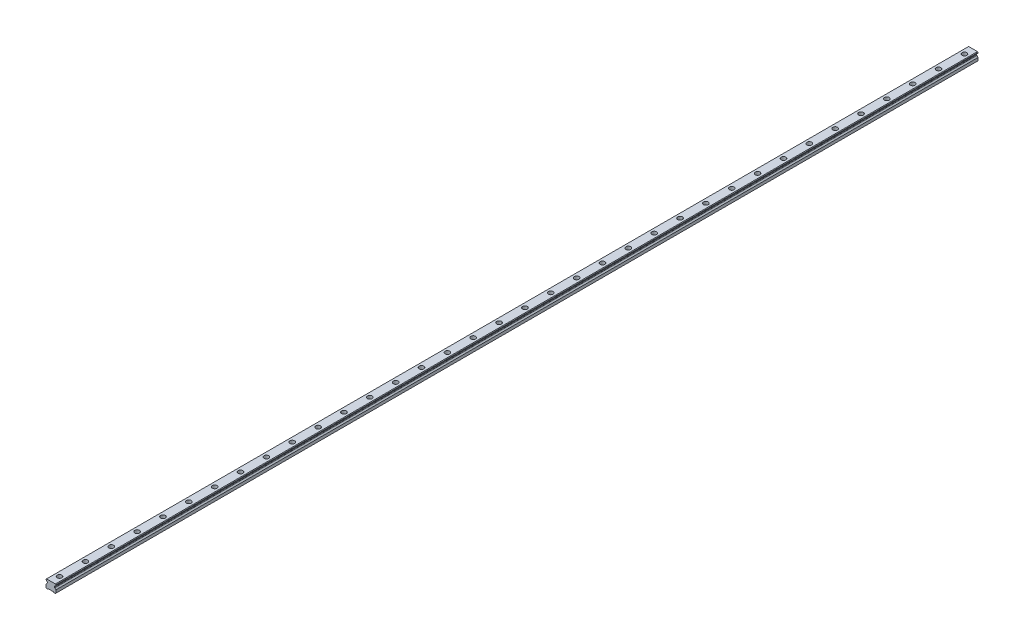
from build123d import *

# Parameters (mm, degrees)
SKETCH1_W           = 23
SKETCH1_H           = 19.2
BOSS_EXTRUDE1_DEPTH = 1070
CUT_EXTRUDE1_DEPTH  = 2141.117027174
CHAMFER1_SIZE       = 1.25
FILLET1_R           = 1.25
CUT_EXTRUDE2_DEPTH  = 2141.117027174
SKETCH4_R           = 5.5
SKETCH4_R_2         = 3.5
CUT_EXTRUDE3_DEPTH  = 9
SKETCH4_2_R         = 3.5
CUT_EXTRUDE4_DEPTH  = 1071.234035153
LPATTERN1_COUNT     = 36
LPATTERN1_PITCH     = 60


with BuildPart() as part:
    # Sketch1 → Boss-Extrude1 (new, symmetric)
    with BuildSketch(Plane.XY):
        with Locations((0, 9.6)):
            Rectangle(SKETCH1_W, SKETCH1_H)
    extrude(amount=BOSS_EXTRUDE1_DEPTH, both=True)

    # Sketch2 → Cut-Extrude1 (cut, through all)
    with BuildSketch(Plane.XY.offset(1070)):
        Polygon((-11.5, 16.7), (-11.5, 7.95), (-8.583333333, 10.866666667), (-8.583333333, 13.783333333), align=None)
        Polygon((8.583333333, 13.783333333), (11.5, 16.7), (11.5, 7.95), (8.583333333, 10.866666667), align=None)
    extrude(amount=-CUT_EXTRUDE1_DEPTH, mode=Mode.SUBTRACT)

    # Chamfer1
    chamfer1_edges = [part.edges().sort_by_distance(p)[0] for p in [
        (-11.5, 19.2, 0),
        (11.5, 19.2, 0),
        (11.5, 0, 0),
        (-11.5, 0, 0),
    ]]
    chamfer(chamfer1_edges, length=CHAMFER1_SIZE)

    # Fillet1
    fillet1_edges = [part.edges().sort_by_distance(p)[0] for p in [
        (-8.583333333, 13.783333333, 0),
        (-8.583333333, 10.866666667, 0),
        (8.583333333, 10.866666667, 0),
        (8.583333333, 13.783333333, 0),
    ]]
    fillet(fillet1_edges, radius=FILLET1_R)

    # Sketch3 → Cut-Extrude2 (cut, through all)
    with BuildSketch(Plane.XY.offset(1070)):
        Polygon((-7, 0), (-5.75, 1.25), (5.75, 1.25), (7, 0), align=None)
    extrude(amount=-CUT_EXTRUDE2_DEPTH, mode=Mode.SUBTRACT)

    # Sketch4 → Cut-Extrude3 (cut)
    with BuildSketch(Plane(origin=(0, 19.2, 0), x_dir=(1, 0, 0), z_dir=(0, 1, 0))):
        with Locations(Location((0, -1050, 0), (0, 0, 270))):
            Circle(SKETCH4_R)
        with Locations(Location((0, -1050, 0), (0, 0, 270))):
            Circle(SKETCH4_R_2, mode=Mode.SUBTRACT)
    cut_extrude3 = extrude(amount=-CUT_EXTRUDE3_DEPTH, mode=Mode.SUBTRACT)

    # Sketch4_2 → Cut-Extrude4 (cut, through all)
    with BuildSketch(Plane(origin=(0, 19.2, 0), x_dir=(1, 0, 0), z_dir=(0, 1, 0))):
        with Locations(Location((0, -1050, 0), (0, 0, 270))):
            Circle(SKETCH4_2_R)
    cut_extrude4 = extrude(amount=-CUT_EXTRUDE4_DEPTH, mode=Mode.SUBTRACT)

    # LPattern1: Cut-Extrude3, Cut-Extrude4 ×36
    with Locations(*[(0, 0, -i * LPATTERN1_PITCH) for i in range(1, LPATTERN1_COUNT)]):
        add(cut_extrude3, mode=Mode.SUBTRACT)
        add(cut_extrude4, mode=Mode.SUBTRACT)


solid = part.part
